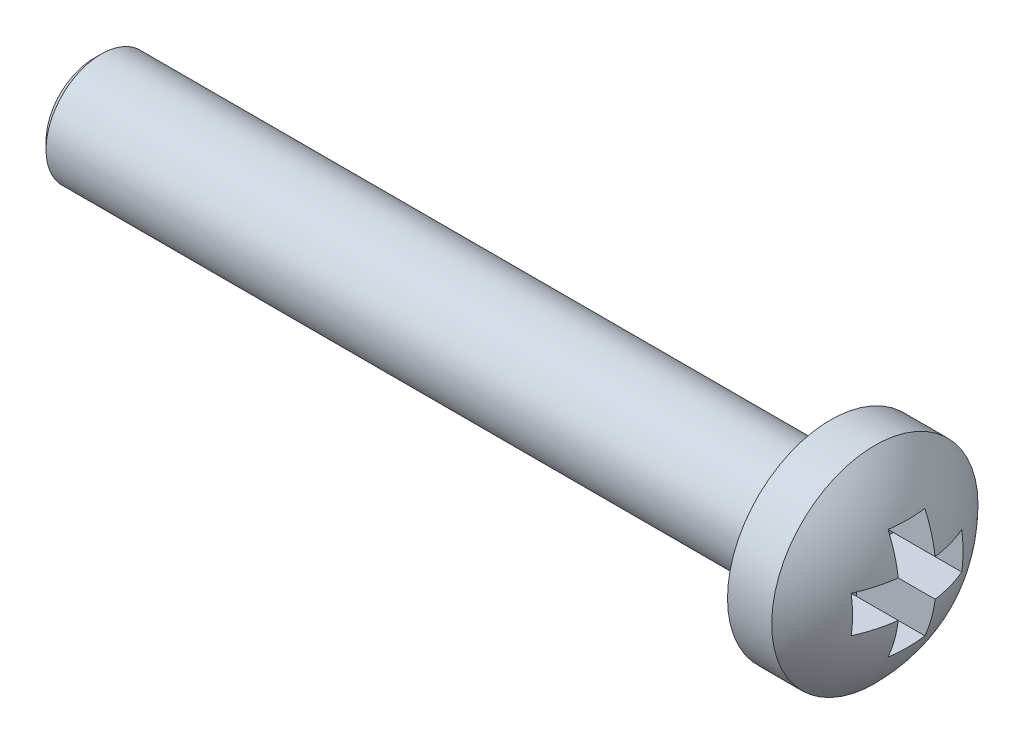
ISO-10303-21;
HEADER;
FILE_DESCRIPTION(('STEP AP214'),'2;1');
FILE_NAME('part.step','',(''),(''),'','','');
FILE_SCHEMA(('AUTOMOTIVE_DESIGN { 1 0 10303 214 1 1 1 1 }'));
ENDSEC;
DATA;
#1=APPLICATION_CONTEXT('core data for automotive mechanical design processes');
#2=APPLICATION_PROTOCOL_DEFINITION('international standard','automotive_design',2000,#1);
#3=PRODUCT_CONTEXT('',#1,'mechanical');
#4=PRODUCT('Part','Part','',(#3));
#5=PRODUCT_RELATED_PRODUCT_CATEGORY('part','',(#4));
#6=PRODUCT_DEFINITION_FORMATION('','',#4);
#7=PRODUCT_DEFINITION_CONTEXT('part definition',#1,'design');
#8=PRODUCT_DEFINITION('design','',#6,#7);
#9=PRODUCT_DEFINITION_SHAPE('','',#8);
#10=(LENGTH_UNIT() NAMED_UNIT(*) SI_UNIT(.MILLI.,.METRE.));
#11=(NAMED_UNIT(*) PLANE_ANGLE_UNIT() SI_UNIT($,.RADIAN.));
#12=(NAMED_UNIT(*) SI_UNIT($,.STERADIAN.) SOLID_ANGLE_UNIT());
#13=UNCERTAINTY_MEASURE_WITH_UNIT(LENGTH_MEASURE(1.E-05),#10,'distance_accuracy_value','');
#14=(GEOMETRIC_REPRESENTATION_CONTEXT(3) GLOBAL_UNCERTAINTY_ASSIGNED_CONTEXT((#13)) GLOBAL_UNIT_ASSIGNED_CONTEXT((#10,
#11,#12)) REPRESENTATION_CONTEXT('',''));
#15=CARTESIAN_POINT('',(0.,0.,0.));
#16=DIRECTION('',(0.,0.,1.));
#17=DIRECTION('',(1.,0.,0.));
#18=AXIS2_PLACEMENT_3D('',#15,#16,#17);
#19=CARTESIAN_POINT('',(2.4,0.,0.));
#20=CARTESIAN_POINT('',(2.4,-1.57169168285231,0.));
#21=CARTESIAN_POINT('',(1.2,-2.8,0.));
#22=B_SPLINE_CURVE_WITH_KNOTS('',2,(#19,#20,#21),.UNSPECIFIED.,.F.,.F.,(3,3),(0.,1.),.UNSPECIFIED.);
#23=CARTESIAN_POINT('',(11.0618266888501,0.,0.));
#24=DIRECTION('',(1.,0.,0.));
#25=AXIS1_PLACEMENT('',#23,#24);
#26=SURFACE_OF_REVOLUTION('',#22,#25);
#27=CARTESIAN_POINT('',(1.2,0.,0.));
#28=DIRECTION('',(1.,0.,0.));
#29=DIRECTION('',(0.,0.,-1.));
#30=AXIS2_PLACEMENT_3D('',#27,#28,#29);
#31=CIRCLE('',#30,2.8);
#32=CARTESIAN_POINT('',(1.2,0.,-2.8));
#33=VERTEX_POINT('',#32);
#34=EDGE_CURVE('E265',#33,#33,#31,.T.);
#35=ORIENTED_EDGE('',*,*,#34,.T.);
#36=EDGE_LOOP('',(#35));
#37=FACE_BOUND('',#36,.T.);
#38=CARTESIAN_POINT('',(2.05758661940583,0.500000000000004,1.49999999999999));
#39=CARTESIAN_POINT('',(2.08308448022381,0.500000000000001,1.44179657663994));
#40=CARTESIAN_POINT('',(2.10709470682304,0.5,1.38295700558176));
#41=CARTESIAN_POINT('',(2.1520554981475,0.5,1.26410705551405));
#42=CARTESIAN_POINT('',(2.17300544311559,0.5,1.204096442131));
#43=CARTESIAN_POINT('',(2.23082558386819,0.5,1.02342732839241));
#44=CARTESIAN_POINT('',(2.2630608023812,0.499999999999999,0.901232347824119));
#45=CARTESIAN_POINT('',(2.29852160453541,0.499999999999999,0.731861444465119));
#46=CARTESIAN_POINT('',(2.30725171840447,0.5,0.685768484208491));
#47=CARTESIAN_POINT('',(2.3229806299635,0.5,0.593159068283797));
#48=CARTESIAN_POINT('',(2.32997465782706,0.5,0.546641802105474));
#49=CARTESIAN_POINT('',(2.33609517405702,0.5,0.500000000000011));
#50=B_SPLINE_CURVE_WITH_KNOTS('',3,(#38,#39,#40,#41,#42,#43,#44,#45,#46,#47,#48,#49),
.UNSPECIFIED.,.F.,.F.,(4,2,2,2,2,4),(0.,0.190580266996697,0.381199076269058,0.759504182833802,
0.900218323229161,1.04131489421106),.UNSPECIFIED.);
#51=CARTESIAN_POINT('',(2.05758661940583,0.5,1.5));
#52=VERTEX_POINT('',#51);
#53=CARTESIAN_POINT('',(2.33609517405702,0.5,0.500000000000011));
#54=VERTEX_POINT('',#53);
#55=EDGE_CURVE('E167',#52,#54,#50,.T.);
#56=ORIENTED_EDGE('',*,*,#55,.T.);
#57=CARTESIAN_POINT('',(2.33609517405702,0.5,0.500000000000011));
#58=CARTESIAN_POINT('',(2.32797490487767,0.561927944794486,0.500000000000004));
#59=CARTESIAN_POINT('',(2.31830112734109,0.623654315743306,0.500000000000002));
#60=CARTESIAN_POINT('',(2.29584316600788,0.746540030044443,0.499999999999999));
#61=CARTESIAN_POINT('',(2.28305889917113,0.807699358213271,0.5));
#62=CARTESIAN_POINT('',(2.25447928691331,0.928850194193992,0.500000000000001));
#63=CARTESIAN_POINT('',(2.23870606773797,0.988846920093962,0.500000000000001));
#64=CARTESIAN_POINT('',(2.20412521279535,1.10795747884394,0.5));
#65=CARTESIAN_POINT('',(2.1853177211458,1.16707135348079,0.5));
#66=CARTESIAN_POINT('',(2.14895095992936,1.27208335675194,0.5));
#67=CARTESIAN_POINT('',(2.13194503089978,1.3181740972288,0.5));
#68=CARTESIAN_POINT('',(2.09611683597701,1.40963903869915,0.500000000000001));
#69=CARTESIAN_POINT('',(2.07729474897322,1.45501330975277,0.500000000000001));
#70=CARTESIAN_POINT('',(2.05758661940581,1.5,0.5));
#71=B_SPLINE_CURVE_WITH_KNOTS('',3,(#57,#58,#59,#60,#61,#62,#63,#64,#65,#66,#67,#68,#69,#70),
.UNSPECIFIED.,.F.,.F.,(4,2,2,2,2,2,4),(0.,0.187357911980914,0.374720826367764,0.560747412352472,
0.746765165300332,0.894111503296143,1.0414433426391),.UNSPECIFIED.);
#72=CARTESIAN_POINT('',(2.05758661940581,1.5,0.5));
#73=VERTEX_POINT('',#72);
#74=EDGE_CURVE('E11',#54,#73,#71,.T.);
#75=ORIENTED_EDGE('',*,*,#74,.T.);
#76=CARTESIAN_POINT('',(2.05758661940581,1.5,0.500000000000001));
#77=CARTESIAN_POINT('',(2.07601190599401,1.5,0.374107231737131));
#78=CARTESIAN_POINT('',(2.08741865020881,1.5,0.247173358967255));
#79=CARTESIAN_POINT('',(2.09618340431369,1.5,-0.00617564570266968));
#80=CARTESIAN_POINT('',(2.09365159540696,1.5,-0.132586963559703));
#81=CARTESIAN_POINT('',(2.07818848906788,1.5,-0.339263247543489));
#82=CARTESIAN_POINT('',(2.0693049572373,1.5,-0.419846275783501));
#83=CARTESIAN_POINT('',(2.05758661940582,1.5,-0.499999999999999));
#84=B_SPLINE_CURVE_WITH_KNOTS('',3,(#76,#77,#78,#79,#80,#81,#82,#83),.UNSPECIFIED.,.F.,.F.,(4,2,
2,4),(0.,0.381541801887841,0.760071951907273,1.00308018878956),.UNSPECIFIED.);
#85=CARTESIAN_POINT('',(2.05758661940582,1.5,-0.5));
#86=VERTEX_POINT('',#85);
#87=EDGE_CURVE('E45',#73,#86,#84,.T.);
#88=ORIENTED_EDGE('',*,*,#87,.T.);
#89=CARTESIAN_POINT('',(2.05758661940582,1.5,-0.499999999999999));
#90=CARTESIAN_POINT('',(2.08308448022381,1.44179657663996,-0.499999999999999));
#91=CARTESIAN_POINT('',(2.10709470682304,1.38295700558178,-0.5));
#92=CARTESIAN_POINT('',(2.1520554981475,1.26410705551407,-0.5));
#93=CARTESIAN_POINT('',(2.17300544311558,1.20409644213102,-0.5));
#94=CARTESIAN_POINT('',(2.23082558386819,1.02342732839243,-0.499999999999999));
#95=CARTESIAN_POINT('',(2.2630608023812,0.901232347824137,-0.499999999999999));
#96=CARTESIAN_POINT('',(2.29852160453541,0.731861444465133,-0.499999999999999));
#97=CARTESIAN_POINT('',(2.30725171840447,0.685768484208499,-0.499999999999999));
#98=CARTESIAN_POINT('',(2.3229806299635,0.593159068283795,-0.5));
#99=CARTESIAN_POINT('',(2.32997465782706,0.546641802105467,-0.5));
#100=CARTESIAN_POINT('',(2.33609517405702,0.5,-0.5));
#101=B_SPLINE_CURVE_WITH_KNOTS('',3,(#89,#90,#91,#92,#93,#94,#95,#96,#97,#98,#99,#100),
.UNSPECIFIED.,.F.,.F.,(4,2,2,2,2,4),(0.,0.190580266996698,0.381199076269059,0.759504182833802,
0.900218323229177,1.04131489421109),.UNSPECIFIED.);
#102=CARTESIAN_POINT('',(2.33609517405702,0.5,-0.5));
#103=VERTEX_POINT('',#102);
#104=EDGE_CURVE('E231',#86,#103,#101,.T.);
#105=ORIENTED_EDGE('',*,*,#104,.T.);
#106=CARTESIAN_POINT('',(2.33609517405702,0.5,-0.5));
#107=CARTESIAN_POINT('',(2.32797490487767,0.5,-0.561927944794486));
#108=CARTESIAN_POINT('',(2.31830112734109,0.5,-0.623654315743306));
#109=CARTESIAN_POINT('',(2.29584316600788,0.5,-0.746540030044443));
#110=CARTESIAN_POINT('',(2.28305889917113,0.5,-0.807699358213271));
#111=CARTESIAN_POINT('',(2.25447928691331,0.5,-0.928850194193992));
#112=CARTESIAN_POINT('',(2.23870606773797,0.5,-0.988846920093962));
#113=CARTESIAN_POINT('',(2.20412521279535,0.5,-1.10795747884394));
#114=CARTESIAN_POINT('',(2.1853177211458,0.5,-1.16707135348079));
#115=CARTESIAN_POINT('',(2.14895095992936,0.5,-1.27208335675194));
#116=CARTESIAN_POINT('',(2.13194503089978,0.5,-1.31817409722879));
#117=CARTESIAN_POINT('',(2.09611683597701,0.5,-1.40963903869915));
#118=CARTESIAN_POINT('',(2.07729474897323,0.5,-1.45501330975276));
#119=CARTESIAN_POINT('',(2.05758661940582,0.5,-1.49999999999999));
#120=B_SPLINE_CURVE_WITH_KNOTS('',3,(#106,#107,#108,#109,#110,#111,#112,#113,#114,#115,#116,
#117,#118,#119),.UNSPECIFIED.,.F.,.F.,(4,2,2,2,2,2,4),(0.,0.187357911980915,0.374720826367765,
0.560747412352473,0.746765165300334,0.894111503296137,1.04144334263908),.UNSPECIFIED.);
#121=CARTESIAN_POINT('',(2.05758661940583,0.5,-1.5));
#122=VERTEX_POINT('',#121);
#123=EDGE_CURVE('E225',#103,#122,#120,.T.);
#124=ORIENTED_EDGE('',*,*,#123,.T.);
#125=CARTESIAN_POINT('',(2.05758661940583,0.500000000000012,-1.49999999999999));
#126=CARTESIAN_POINT('',(2.07601190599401,0.374107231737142,-1.5));
#127=CARTESIAN_POINT('',(2.0874186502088,0.247173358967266,-1.5));
#128=CARTESIAN_POINT('',(2.09618340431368,-0.00617564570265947,-1.5));
#129=CARTESIAN_POINT('',(2.09365159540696,-0.132586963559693,-1.5));
#130=CARTESIAN_POINT('',(2.07818848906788,-0.339263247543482,-1.5));
#131=CARTESIAN_POINT('',(2.0693049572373,-0.419846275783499,-1.5));
#132=CARTESIAN_POINT('',(2.05758661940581,-0.500000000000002,-1.5));
#133=B_SPLINE_CURVE_WITH_KNOTS('',3,(#125,#126,#127,#128,#129,#130,#131,#132),.UNSPECIFIED.,.F.,
.F.,(4,2,2,4),(0.,0.38154180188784,0.760071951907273,1.00308018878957),.UNSPECIFIED.);
#134=CARTESIAN_POINT('',(2.05758661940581,-0.5,-1.5));
#135=VERTEX_POINT('',#134);
#136=EDGE_CURVE('E218',#122,#135,#133,.T.);
#137=ORIENTED_EDGE('',*,*,#136,.T.);
#138=CARTESIAN_POINT('',(2.05758661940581,-0.500000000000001,-1.5));
#139=CARTESIAN_POINT('',(2.0830844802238,-0.5,-1.44179657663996));
#140=CARTESIAN_POINT('',(2.10709470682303,-0.5,-1.38295700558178));
#141=CARTESIAN_POINT('',(2.1520554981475,-0.5,-1.26410705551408));
#142=CARTESIAN_POINT('',(2.17300544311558,-0.5,-1.20409644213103));
#143=CARTESIAN_POINT('',(2.23082558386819,-0.5,-1.02342732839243));
#144=CARTESIAN_POINT('',(2.2630608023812,-0.499999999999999,-0.901232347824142));
#145=CARTESIAN_POINT('',(2.29852160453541,-0.5,-0.731861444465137));
#146=CARTESIAN_POINT('',(2.30725171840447,-0.5,-0.685768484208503));
#147=CARTESIAN_POINT('',(2.3229806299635,-0.5,-0.593159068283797));
#148=CARTESIAN_POINT('',(2.32997465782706,-0.5,-0.546641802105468));
#149=CARTESIAN_POINT('',(2.33609517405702,-0.5,-0.5));
#150=B_SPLINE_CURVE_WITH_KNOTS('',3,(#138,#139,#140,#141,#142,#143,#144,#145,#146,#147,#148,
#149),.UNSPECIFIED.,.F.,.F.,(4,2,2,2,2,4),(0.,0.190580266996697,0.381199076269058,
0.759504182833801,0.900218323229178,1.0413148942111),.UNSPECIFIED.);
#151=CARTESIAN_POINT('',(2.33609517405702,-0.5,-0.5));
#152=VERTEX_POINT('',#151);
#153=EDGE_CURVE('E211',#135,#152,#150,.T.);
#154=ORIENTED_EDGE('',*,*,#153,.T.);
#155=CARTESIAN_POINT('',(2.33609517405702,-0.5,-0.5));
#156=CARTESIAN_POINT('',(2.32797490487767,-0.561927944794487,-0.5));
#157=CARTESIAN_POINT('',(2.31830112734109,-0.623654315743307,-0.5));
#158=CARTESIAN_POINT('',(2.29584316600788,-0.746540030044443,-0.5));
#159=CARTESIAN_POINT('',(2.28305889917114,-0.807699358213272,-0.5));
#160=CARTESIAN_POINT('',(2.25447928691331,-0.928850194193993,-0.5));
#161=CARTESIAN_POINT('',(2.23870606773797,-0.988846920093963,-0.5));
#162=CARTESIAN_POINT('',(2.20412521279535,-1.10795747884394,-0.5));
#163=CARTESIAN_POINT('',(2.1853177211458,-1.16707135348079,-0.5));
#164=CARTESIAN_POINT('',(2.14895095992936,-1.27208335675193,-0.5));
#165=CARTESIAN_POINT('',(2.13194503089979,-1.31817409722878,-0.5));
#166=CARTESIAN_POINT('',(2.09611683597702,-1.40963903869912,-0.499999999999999));
#167=CARTESIAN_POINT('',(2.07729474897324,-1.45501330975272,-0.499999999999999));
#168=CARTESIAN_POINT('',(2.05758661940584,-1.49999999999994,-0.499999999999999));
#169=B_SPLINE_CURVE_WITH_KNOTS('',3,(#155,#156,#157,#158,#159,#160,#161,#162,#163,#164,#165,
#166,#167,#168),.UNSPECIFIED.,.F.,.F.,(4,2,2,2,2,2,4),(0.,0.187357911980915,0.374720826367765,
0.560747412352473,0.746765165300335,0.894111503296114,1.04144334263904),.UNSPECIFIED.);
#170=CARTESIAN_POINT('',(2.05758661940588,-1.5,-0.5));
#171=VERTEX_POINT('',#170);
#172=EDGE_CURVE('E204',#152,#171,#169,.T.);
#173=ORIENTED_EDGE('',*,*,#172,.T.);
#174=CARTESIAN_POINT('',(2.05758661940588,-1.49999999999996,-0.499999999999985));
#175=CARTESIAN_POINT('',(2.07601190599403,-1.49999999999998,-0.374107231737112));
#176=CARTESIAN_POINT('',(2.08741865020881,-1.5,-0.247173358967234));
#177=CARTESIAN_POINT('',(2.09618340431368,-1.5,0.00617564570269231));
#178=CARTESIAN_POINT('',(2.09365159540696,-1.5,0.132586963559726));
#179=CARTESIAN_POINT('',(2.07818848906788,-1.5,0.339263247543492));
#180=CARTESIAN_POINT('',(2.06930495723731,-1.5,0.419846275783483));
#181=CARTESIAN_POINT('',(2.05758661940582,-1.5,0.499999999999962));
#182=B_SPLINE_CURVE_WITH_KNOTS('',3,(#174,#175,#176,#177,#178,#179,#180,#181),.UNSPECIFIED.,.F.,
.F.,(4,2,2,4),(0.,0.38154180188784,0.760071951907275,1.0030801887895),.UNSPECIFIED.);
#183=CARTESIAN_POINT('',(2.05758661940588,-1.5,0.5));
#184=VERTEX_POINT('',#183);
#185=EDGE_CURVE('E197',#171,#184,#182,.T.);
#186=ORIENTED_EDGE('',*,*,#185,.T.);
#187=CARTESIAN_POINT('',(2.05758661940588,-1.49999999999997,0.499999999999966));
#188=CARTESIAN_POINT('',(2.08308448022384,-1.44179657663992,0.499999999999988));
#189=CARTESIAN_POINT('',(2.10709470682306,-1.38295700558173,0.499999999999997));
#190=CARTESIAN_POINT('',(2.15205549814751,-1.26410705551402,0.500000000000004));
#191=CARTESIAN_POINT('',(2.1730054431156,-1.20409644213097,0.500000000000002));
#192=CARTESIAN_POINT('',(2.2308255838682,-1.02342732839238,0.499999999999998));
#193=CARTESIAN_POINT('',(2.26306080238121,-0.901232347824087,0.499999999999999));
#194=CARTESIAN_POINT('',(2.29852160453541,-0.73186144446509,0.5));
#195=CARTESIAN_POINT('',(2.30725171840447,-0.685768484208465,0.5));
#196=CARTESIAN_POINT('',(2.3229806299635,-0.593159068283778,0.500000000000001));
#197=CARTESIAN_POINT('',(2.32997465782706,-0.546641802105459,0.500000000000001));
#198=CARTESIAN_POINT('',(2.33609517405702,-0.5,0.5));
#199=B_SPLINE_CURVE_WITH_KNOTS('',3,(#187,#188,#189,#190,#191,#192,#193,#194,#195,#196,#197,
#198),.UNSPECIFIED.,.F.,.F.,(4,2,2,2,2,4),(0.,0.190580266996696,0.381199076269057,
0.759504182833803,0.900218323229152,1.04131489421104),.UNSPECIFIED.);
#200=CARTESIAN_POINT('',(2.33609517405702,-0.5,0.5));
#201=VERTEX_POINT('',#200);
#202=EDGE_CURVE('E190',#184,#201,#199,.T.);
#203=ORIENTED_EDGE('',*,*,#202,.T.);
#204=CARTESIAN_POINT('',(2.33609517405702,-0.5,0.5));
#205=CARTESIAN_POINT('',(2.32797490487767,-0.5,0.561927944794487));
#206=CARTESIAN_POINT('',(2.31830112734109,-0.5,0.623654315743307));
#207=CARTESIAN_POINT('',(2.29584316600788,-0.5,0.746540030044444));
#208=CARTESIAN_POINT('',(2.28305889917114,-0.5,0.807699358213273));
#209=CARTESIAN_POINT('',(2.25447928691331,-0.5,0.928850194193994));
#210=CARTESIAN_POINT('',(2.23870606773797,-0.5,0.988846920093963));
#211=CARTESIAN_POINT('',(2.20412521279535,-0.5,1.10795747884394));
#212=CARTESIAN_POINT('',(2.1853177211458,-0.500000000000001,1.16707135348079));
#213=CARTESIAN_POINT('',(2.14895095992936,-0.500000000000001,1.27208335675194));
#214=CARTESIAN_POINT('',(2.13194503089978,-0.5,1.3181740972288));
#215=CARTESIAN_POINT('',(2.09611683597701,-0.5,1.40963903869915));
#216=CARTESIAN_POINT('',(2.07729474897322,-0.5,1.45501330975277));
#217=CARTESIAN_POINT('',(2.05758661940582,-0.500000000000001,1.5));
#218=B_SPLINE_CURVE_WITH_KNOTS('',3,(#204,#205,#206,#207,#208,#209,#210,#211,#212,#213,#214,
#215,#216,#217),.UNSPECIFIED.,.F.,.F.,(4,2,2,2,2,2,4),(0.,0.187357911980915,0.374720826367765,
0.560747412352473,0.746765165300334,0.894111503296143,1.0414433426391),.UNSPECIFIED.);
#219=CARTESIAN_POINT('',(2.05758661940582,-0.5,1.5));
#220=VERTEX_POINT('',#219);
#221=EDGE_CURVE('E183',#201,#220,#218,.T.);
#222=ORIENTED_EDGE('',*,*,#221,.T.);
#223=CARTESIAN_POINT('',(2.05758661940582,-0.499999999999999,1.5));
#224=CARTESIAN_POINT('',(2.07601190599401,-0.374107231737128,1.5));
#225=CARTESIAN_POINT('',(2.0874186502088,-0.247173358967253,1.5));
#226=CARTESIAN_POINT('',(2.09618340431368,0.00617564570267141,1.5));
#227=CARTESIAN_POINT('',(2.09365159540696,0.132586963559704,1.5));
#228=CARTESIAN_POINT('',(2.07818848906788,0.339263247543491,1.5));
#229=CARTESIAN_POINT('',(2.0693049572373,0.419846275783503,1.5));
#230=CARTESIAN_POINT('',(2.05758661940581,0.500000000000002,1.5));
#231=B_SPLINE_CURVE_WITH_KNOTS('',3,(#223,#224,#225,#226,#227,#228,#229,#230),.UNSPECIFIED.,.F.,
.F.,(4,2,2,4),(0.,0.38154180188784,0.760071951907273,1.00308018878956),.UNSPECIFIED.);
#232=EDGE_CURVE('E176',#220,#52,#231,.T.);
#233=ORIENTED_EDGE('',*,*,#232,.T.);
#234=EDGE_LOOP('',(#56,#75,#88,#105,#124,#137,#154,#173,#186,#203,#222,#233));
#235=FACE_BOUND('',#234,.T.);
#236=ADVANCED_FACE('F33',(#37,#235),#26,.F.);
#237=CARTESIAN_POINT('',(11.0618266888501,0.,0.));
#238=DIRECTION('',(1.,0.,0.));
#239=DIRECTION('',(0.,0.,-1.));
#240=AXIS2_PLACEMENT_3D('',#237,#238,#239);
#241=CYLINDRICAL_SURFACE('',#240,2.8);
#242=CARTESIAN_POINT('',(0.,0.,0.));
#243=DIRECTION('',(1.,0.,0.));
#244=DIRECTION('',(0.,0.,-1.));
#245=AXIS2_PLACEMENT_3D('',#242,#243,#244);
#246=CIRCLE('',#245,2.8);
#247=CARTESIAN_POINT('',(0.,0.,-2.8));
#248=VERTEX_POINT('',#247);
#249=EDGE_CURVE('E145',#248,#248,#246,.T.);
#250=ORIENTED_EDGE('',*,*,#249,.T.);
#251=EDGE_LOOP('',(#250));
#252=FACE_BOUND('',#251,.T.);
#253=ORIENTED_EDGE('',*,*,#34,.F.);
#254=EDGE_LOOP('',(#253));
#255=FACE_BOUND('',#254,.T.);
#256=ADVANCED_FACE('F161',(#252,#255),#241,.T.);
#257=CARTESIAN_POINT('',(0.,-1.5,0.));
#258=DIRECTION('',(-1.,0.,0.));
#259=DIRECTION('',(0.,0.,1.));
#260=AXIS2_PLACEMENT_3D('',#257,#258,#259);
#261=PLANE('',#260);
#262=CARTESIAN_POINT('',(0.,0.,0.));
#263=DIRECTION('',(1.,0.,0.));
#264=DIRECTION('',(0.,0.,-1.));
#265=AXIS2_PLACEMENT_3D('',#262,#263,#264);
#266=CIRCLE('',#265,1.5);
#267=CARTESIAN_POINT('',(0.,0.,-1.5));
#268=VERTEX_POINT('',#267);
#269=EDGE_CURVE('E141',#268,#268,#266,.T.);
#270=ORIENTED_EDGE('',*,*,#269,.T.);
#271=EDGE_LOOP('',(#270));
#272=FACE_BOUND('',#271,.T.);
#273=ORIENTED_EDGE('',*,*,#249,.F.);
#274=EDGE_LOOP('',(#273));
#275=FACE_BOUND('',#274,.T.);
#276=ADVANCED_FACE('F253',(#272,#275),#261,.T.);
#277=CARTESIAN_POINT('',(11.0618266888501,0.,0.));
#278=DIRECTION('',(1.,0.,0.));
#279=DIRECTION('',(0.,0.,-1.));
#280=AXIS2_PLACEMENT_3D('',#277,#278,#279);
#281=CYLINDRICAL_SURFACE('',#280,1.5);
#282=CARTESIAN_POINT('',(-19.8,0.,0.));
#283=DIRECTION('',(-1.,0.,0.));
#284=DIRECTION('',(0.,0.,1.));
#285=AXIS2_PLACEMENT_3D('',#282,#283,#284);
#286=CIRCLE('',#285,1.5);
#287=CARTESIAN_POINT('',(-19.8,0.,1.5));
#288=VERTEX_POINT('',#287);
#289=EDGE_CURVE('E267',#288,#288,#286,.F.);
#290=ORIENTED_EDGE('',*,*,#289,.T.);
#291=EDGE_LOOP('',(#290));
#292=FACE_BOUND('',#291,.T.);
#293=ORIENTED_EDGE('',*,*,#269,.F.);
#294=EDGE_LOOP('',(#293));
#295=FACE_BOUND('',#294,.T.);
#296=ADVANCED_FACE('F250',(#292,#295),#281,.T.);
#297=CARTESIAN_POINT('',(-20.,-1.5,0.));
#298=DIRECTION('',(-1.,0.,0.));
#299=DIRECTION('',(0.,0.,1.));
#300=AXIS2_PLACEMENT_3D('',#297,#298,#299);
#301=PLANE('',#300);
#302=CARTESIAN_POINT('',(-20.,0.,0.));
#303=DIRECTION('',(-1.,0.,0.));
#304=DIRECTION('',(0.,0.,1.));
#305=AXIS2_PLACEMENT_3D('',#302,#303,#304);
#306=CIRCLE('',#305,1.29999999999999);
#307=CARTESIAN_POINT('',(-20.,0.,1.29999999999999));
#308=VERTEX_POINT('',#307);
#309=EDGE_CURVE('E271',#308,#308,#306,.T.);
#310=ORIENTED_EDGE('',*,*,#309,.T.);
#311=EDGE_LOOP('',(#310));
#312=FACE_BOUND('',#311,.T.);
#313=ADVANCED_FACE('F247',(#312),#301,.T.);
#314=CARTESIAN_POINT('',(-19.8,0.,0.));
#315=DIRECTION('',(1.,0.,0.));
#316=DIRECTION('',(0.,0.,-1.));
#317=AXIS2_PLACEMENT_3D('',#314,#315,#316);
#318=CONICAL_SURFACE('',#317,1.5,0.785398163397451);
#319=ORIENTED_EDGE('',*,*,#309,.F.);
#320=EDGE_LOOP('',(#319));
#321=FACE_BOUND('',#320,.T.);
#322=ORIENTED_EDGE('',*,*,#289,.F.);
#323=EDGE_LOOP('',(#322));
#324=FACE_BOUND('',#323,.T.);
#325=ADVANCED_FACE('F35',(#321,#324),#318,.T.);
#326=CARTESIAN_POINT('',(0.2,1.5,0.5));
#327=DIRECTION('',(0.,0.,-1.));
#328=DIRECTION('',(-1.,0.,0.));
#329=AXIS2_PLACEMENT_3D('',#326,#327,#328);
#330=PLANE('',#329);
#331=DIRECTION('',(1.,0.,0.));
#332=VECTOR('',#331,1.);
#333=CARTESIAN_POINT('',(0.2,0.5,0.5));
#334=LINE('',#333,#332);
#335=CARTESIAN_POINT('',(0.2,0.5,0.5));
#336=VERTEX_POINT('',#335);
#337=EDGE_CURVE('E52',#336,#54,#334,.T.);
#338=ORIENTED_EDGE('',*,*,#337,.F.);
#339=DIRECTION('',(0.,1.,0.));
#340=VECTOR('',#339,1.);
#341=CARTESIAN_POINT('',(0.2,1.5,0.5));
#342=LINE('',#341,#340);
#343=CARTESIAN_POINT('',(0.2,1.5,0.5));
#344=VERTEX_POINT('',#343);
#345=EDGE_CURVE('E131',#336,#344,#342,.T.);
#346=ORIENTED_EDGE('',*,*,#345,.T.);
#347=DIRECTION('',(1.,0.,0.));
#348=VECTOR('',#347,1.);
#349=CARTESIAN_POINT('',(0.2,1.5,0.5));
#350=LINE('',#349,#348);
#351=EDGE_CURVE('E138',#344,#73,#350,.T.);
#352=ORIENTED_EDGE('',*,*,#351,.T.);
#353=ORIENTED_EDGE('',*,*,#74,.F.);
#354=EDGE_LOOP('',(#338,#346,#352,#353));
#355=FACE_BOUND('',#354,.T.);
#356=ADVANCED_FACE('F137',(#355),#330,.T.);
#357=CARTESIAN_POINT('',(0.2,1.5,0.5));
#358=DIRECTION('',(0.,-1.,0.));
#359=DIRECTION('',(0.,0.,-1.));
#360=AXIS2_PLACEMENT_3D('',#357,#358,#359);
#361=PLANE('',#360);
#362=ORIENTED_EDGE('',*,*,#351,.F.);
#363=DIRECTION('',(0.,0.,-1.));
#364=VECTOR('',#363,1.);
#365=CARTESIAN_POINT('',(0.2,1.5,0.5));
#366=LINE('',#365,#364);
#367=CARTESIAN_POINT('',(0.2,1.5,-0.5));
#368=VERTEX_POINT('',#367);
#369=EDGE_CURVE('E127',#344,#368,#366,.T.);
#370=ORIENTED_EDGE('',*,*,#369,.T.);
#371=DIRECTION('',(1.,0.,0.));
#372=VECTOR('',#371,1.);
#373=CARTESIAN_POINT('',(0.2,1.5,-0.5));
#374=LINE('',#373,#372);
#375=EDGE_CURVE('E142',#368,#86,#374,.T.);
#376=ORIENTED_EDGE('',*,*,#375,.T.);
#377=ORIENTED_EDGE('',*,*,#87,.F.);
#378=EDGE_LOOP('',(#362,#370,#376,#377));
#379=FACE_BOUND('',#378,.T.);
#380=ADVANCED_FACE('F140',(#379),#361,.T.);
#381=CARTESIAN_POINT('',(0.2,1.5,-0.5));
#382=DIRECTION('',(0.,0.,1.));
#383=DIRECTION('',(1.,0.,0.));
#384=AXIS2_PLACEMENT_3D('',#381,#382,#383);
#385=PLANE('',#384);
#386=ORIENTED_EDGE('',*,*,#375,.F.);
#387=DIRECTION('',(0.,-1.,0.));
#388=VECTOR('',#387,1.);
#389=CARTESIAN_POINT('',(0.2,1.5,-0.5));
#390=LINE('',#389,#388);
#391=CARTESIAN_POINT('',(0.2,0.5,-0.5));
#392=VERTEX_POINT('',#391);
#393=EDGE_CURVE('E133',#368,#392,#390,.T.);
#394=ORIENTED_EDGE('',*,*,#393,.T.);
#395=DIRECTION('',(1.,0.,0.));
#396=VECTOR('',#395,1.);
#397=CARTESIAN_POINT('',(0.2,0.5,-0.5));
#398=LINE('',#397,#396);
#399=EDGE_CURVE('E147',#392,#103,#398,.T.);
#400=ORIENTED_EDGE('',*,*,#399,.T.);
#401=ORIENTED_EDGE('',*,*,#104,.F.);
#402=EDGE_LOOP('',(#386,#394,#400,#401));
#403=FACE_BOUND('',#402,.T.);
#404=ADVANCED_FACE('F242',(#403),#385,.T.);
#405=CARTESIAN_POINT('',(0.2,0.5,-0.5));
#406=DIRECTION('',(0.,-1.,0.));
#407=DIRECTION('',(0.,0.,-1.));
#408=AXIS2_PLACEMENT_3D('',#405,#406,#407);
#409=PLANE('',#408);
#410=ORIENTED_EDGE('',*,*,#399,.F.);
#411=DIRECTION('',(0.,0.,-1.));
#412=VECTOR('',#411,1.);
#413=CARTESIAN_POINT('',(0.2,0.5,-0.5));
#414=LINE('',#413,#412);
#415=CARTESIAN_POINT('',(0.2,0.5,-1.5));
#416=VERTEX_POINT('',#415);
#417=EDGE_CURVE('E331',#392,#416,#414,.T.);
#418=ORIENTED_EDGE('',*,*,#417,.T.);
#419=DIRECTION('',(1.,0.,0.));
#420=VECTOR('',#419,1.);
#421=CARTESIAN_POINT('',(0.2,0.5,-1.5));
#422=LINE('',#421,#420);
#423=EDGE_CURVE('E289',#416,#122,#422,.T.);
#424=ORIENTED_EDGE('',*,*,#423,.T.);
#425=ORIENTED_EDGE('',*,*,#123,.F.);
#426=EDGE_LOOP('',(#410,#418,#424,#425));
#427=FACE_BOUND('',#426,.T.);
#428=ADVANCED_FACE('F334',(#427),#409,.T.);
#429=CARTESIAN_POINT('',(0.2,0.5,-1.5));
#430=DIRECTION('',(0.,0.,1.));
#431=DIRECTION('',(1.,0.,0.));
#432=AXIS2_PLACEMENT_3D('',#429,#430,#431);
#433=PLANE('',#432);
#434=ORIENTED_EDGE('',*,*,#423,.F.);
#435=DIRECTION('',(0.,-1.,0.));
#436=VECTOR('',#435,1.);
#437=CARTESIAN_POINT('',(0.2,0.5,-1.5));
#438=LINE('',#437,#436);
#439=CARTESIAN_POINT('',(0.2,-0.5,-1.5));
#440=VERTEX_POINT('',#439);
#441=EDGE_CURVE('E329',#416,#440,#438,.T.);
#442=ORIENTED_EDGE('',*,*,#441,.T.);
#443=DIRECTION('',(1.,0.,0.));
#444=VECTOR('',#443,1.);
#445=CARTESIAN_POINT('',(0.2,-0.5,-1.5));
#446=LINE('',#445,#444);
#447=EDGE_CURVE('E291',#440,#135,#446,.T.);
#448=ORIENTED_EDGE('',*,*,#447,.T.);
#449=ORIENTED_EDGE('',*,*,#136,.F.);
#450=EDGE_LOOP('',(#434,#442,#448,#449));
#451=FACE_BOUND('',#450,.T.);
#452=ADVANCED_FACE('F337',(#451),#433,.T.);
#453=CARTESIAN_POINT('',(0.2,-0.5,-0.5));
#454=DIRECTION('',(0.,1.,0.));
#455=DIRECTION('',(0.,0.,1.));
#456=AXIS2_PLACEMENT_3D('',#453,#454,#455);
#457=PLANE('',#456);
#458=ORIENTED_EDGE('',*,*,#447,.F.);
#459=DIRECTION('',(0.,0.,1.));
#460=VECTOR('',#459,1.);
#461=CARTESIAN_POINT('',(0.2,-0.5,-0.5));
#462=LINE('',#461,#460);
#463=CARTESIAN_POINT('',(0.2,-0.5,-0.5));
#464=VERTEX_POINT('',#463);
#465=EDGE_CURVE('E327',#440,#464,#462,.T.);
#466=ORIENTED_EDGE('',*,*,#465,.T.);
#467=DIRECTION('',(1.,0.,0.));
#468=VECTOR('',#467,1.);
#469=CARTESIAN_POINT('',(0.2,-0.5,-0.5));
#470=LINE('',#469,#468);
#471=EDGE_CURVE('E296',#464,#152,#470,.T.);
#472=ORIENTED_EDGE('',*,*,#471,.T.);
#473=ORIENTED_EDGE('',*,*,#153,.F.);
#474=EDGE_LOOP('',(#458,#466,#472,#473));
#475=FACE_BOUND('',#474,.T.);
#476=ADVANCED_FACE('F344',(#475),#457,.T.);
#477=CARTESIAN_POINT('',(0.2,-0.5,-0.5));
#478=DIRECTION('',(0.,0.,1.));
#479=DIRECTION('',(0.,-1.,0.));
#480=AXIS2_PLACEMENT_3D('',#477,#478,#479);
#481=PLANE('',#480);
#482=ORIENTED_EDGE('',*,*,#471,.F.);
#483=DIRECTION('',(0.,-1.,0.));
#484=VECTOR('',#483,1.);
#485=CARTESIAN_POINT('',(0.2,-0.5,-0.5));
#486=LINE('',#485,#484);
#487=CARTESIAN_POINT('',(0.2,-1.5,-0.5));
#488=VERTEX_POINT('',#487);
#489=EDGE_CURVE('E325',#464,#488,#486,.T.);
#490=ORIENTED_EDGE('',*,*,#489,.T.);
#491=DIRECTION('',(1.,0.,0.));
#492=VECTOR('',#491,1.);
#493=CARTESIAN_POINT('',(0.2,-1.5,-0.5));
#494=LINE('',#493,#492);
#495=EDGE_CURVE('E299',#488,#171,#494,.T.);
#496=ORIENTED_EDGE('',*,*,#495,.T.);
#497=ORIENTED_EDGE('',*,*,#172,.F.);
#498=EDGE_LOOP('',(#482,#490,#496,#497));
#499=FACE_BOUND('',#498,.T.);
#500=ADVANCED_FACE('F346',(#499),#481,.T.);
#501=CARTESIAN_POINT('',(0.2,-1.5,0.5));
#502=DIRECTION('',(0.,1.,0.));
#503=DIRECTION('',(0.,0.,1.));
#504=AXIS2_PLACEMENT_3D('',#501,#502,#503);
#505=PLANE('',#504);
#506=ORIENTED_EDGE('',*,*,#495,.F.);
#507=DIRECTION('',(0.,0.,1.));
#508=VECTOR('',#507,1.);
#509=CARTESIAN_POINT('',(0.2,-1.5,0.5));
#510=LINE('',#509,#508);
#511=CARTESIAN_POINT('',(0.2,-1.5,0.5));
#512=VERTEX_POINT('',#511);
#513=EDGE_CURVE('E323',#488,#512,#510,.T.);
#514=ORIENTED_EDGE('',*,*,#513,.T.);
#515=DIRECTION('',(1.,0.,0.));
#516=VECTOR('',#515,1.);
#517=CARTESIAN_POINT('',(0.2,-1.5,0.5));
#518=LINE('',#517,#516);
#519=EDGE_CURVE('E302',#512,#184,#518,.T.);
#520=ORIENTED_EDGE('',*,*,#519,.T.);
#521=ORIENTED_EDGE('',*,*,#185,.F.);
#522=EDGE_LOOP('',(#506,#514,#520,#521));
#523=FACE_BOUND('',#522,.T.);
#524=ADVANCED_FACE('F349',(#523),#505,.T.);
#525=CARTESIAN_POINT('',(0.2,-0.5,0.5));
#526=DIRECTION('',(0.,0.,-1.));
#527=DIRECTION('',(-1.,0.,0.));
#528=AXIS2_PLACEMENT_3D('',#525,#526,#527);
#529=PLANE('',#528);
#530=ORIENTED_EDGE('',*,*,#519,.F.);
#531=DIRECTION('',(0.,1.,0.));
#532=VECTOR('',#531,1.);
#533=CARTESIAN_POINT('',(0.2,-0.5,0.5));
#534=LINE('',#533,#532);
#535=CARTESIAN_POINT('',(0.2,-0.5,0.5));
#536=VERTEX_POINT('',#535);
#537=EDGE_CURVE('E321',#512,#536,#534,.T.);
#538=ORIENTED_EDGE('',*,*,#537,.T.);
#539=DIRECTION('',(1.,0.,0.));
#540=VECTOR('',#539,1.);
#541=CARTESIAN_POINT('',(0.2,-0.5,0.5));
#542=LINE('',#541,#540);
#543=EDGE_CURVE('E305',#536,#201,#542,.T.);
#544=ORIENTED_EDGE('',*,*,#543,.T.);
#545=ORIENTED_EDGE('',*,*,#202,.F.);
#546=EDGE_LOOP('',(#530,#538,#544,#545));
#547=FACE_BOUND('',#546,.T.);
#548=ADVANCED_FACE('F356',(#547),#529,.T.);
#549=CARTESIAN_POINT('',(0.2,-0.5,1.5));
#550=DIRECTION('',(0.,1.,0.));
#551=DIRECTION('',(0.,0.,1.));
#552=AXIS2_PLACEMENT_3D('',#549,#550,#551);
#553=PLANE('',#552);
#554=ORIENTED_EDGE('',*,*,#543,.F.);
#555=DIRECTION('',(0.,0.,1.));
#556=VECTOR('',#555,1.);
#557=CARTESIAN_POINT('',(0.2,-0.5,1.5));
#558=LINE('',#557,#556);
#559=CARTESIAN_POINT('',(0.2,-0.5,1.5));
#560=VERTEX_POINT('',#559);
#561=EDGE_CURVE('E319',#536,#560,#558,.T.);
#562=ORIENTED_EDGE('',*,*,#561,.T.);
#563=DIRECTION('',(1.,0.,0.));
#564=VECTOR('',#563,1.);
#565=CARTESIAN_POINT('',(0.2,-0.5,1.5));
#566=LINE('',#565,#564);
#567=EDGE_CURVE('E308',#560,#220,#566,.T.);
#568=ORIENTED_EDGE('',*,*,#567,.T.);
#569=ORIENTED_EDGE('',*,*,#221,.F.);
#570=EDGE_LOOP('',(#554,#562,#568,#569));
#571=FACE_BOUND('',#570,.T.);
#572=ADVANCED_FACE('F358',(#571),#553,.T.);
#573=CARTESIAN_POINT('',(0.2,0.5,1.5));
#574=DIRECTION('',(0.,0.,-1.));
#575=DIRECTION('',(0.,1.,0.));
#576=AXIS2_PLACEMENT_3D('',#573,#574,#575);
#577=PLANE('',#576);
#578=ORIENTED_EDGE('',*,*,#567,.F.);
#579=DIRECTION('',(0.,1.,0.));
#580=VECTOR('',#579,1.);
#581=CARTESIAN_POINT('',(0.2,0.5,1.5));
#582=LINE('',#581,#580);
#583=CARTESIAN_POINT('',(0.2,0.5,1.5));
#584=VERTEX_POINT('',#583);
#585=EDGE_CURVE('E317',#560,#584,#582,.T.);
#586=ORIENTED_EDGE('',*,*,#585,.T.);
#587=DIRECTION('',(1.,0.,0.));
#588=VECTOR('',#587,1.);
#589=CARTESIAN_POINT('',(0.2,0.5,1.5));
#590=LINE('',#589,#588);
#591=EDGE_CURVE('E311',#584,#52,#590,.T.);
#592=ORIENTED_EDGE('',*,*,#591,.T.);
#593=ORIENTED_EDGE('',*,*,#232,.F.);
#594=EDGE_LOOP('',(#578,#586,#592,#593));
#595=FACE_BOUND('',#594,.T.);
#596=ADVANCED_FACE('F361',(#595),#577,.T.);
#597=CARTESIAN_POINT('',(0.2,0.5,1.5));
#598=DIRECTION('',(0.,-1.,0.));
#599=DIRECTION('',(0.,0.,-1.));
#600=AXIS2_PLACEMENT_3D('',#597,#598,#599);
#601=PLANE('',#600);
#602=ORIENTED_EDGE('',*,*,#591,.F.);
#603=DIRECTION('',(0.,0.,-1.));
#604=VECTOR('',#603,1.);
#605=CARTESIAN_POINT('',(0.2,0.5,1.5));
#606=LINE('',#605,#604);
#607=EDGE_CURVE('E315',#584,#336,#606,.T.);
#608=ORIENTED_EDGE('',*,*,#607,.T.);
#609=ORIENTED_EDGE('',*,*,#337,.T.);
#610=ORIENTED_EDGE('',*,*,#55,.F.);
#611=EDGE_LOOP('',(#602,#608,#609,#610));
#612=FACE_BOUND('',#611,.T.);
#613=ADVANCED_FACE('F363',(#612),#601,.T.);
#614=CARTESIAN_POINT('',(0.2,0.5,0.5));
#615=DIRECTION('',(1.,0.,0.));
#616=DIRECTION('',(0.,0.,-1.));
#617=AXIS2_PLACEMENT_3D('',#614,#615,#616);
#618=PLANE('',#617);
#619=ORIENTED_EDGE('',*,*,#345,.F.);
#620=ORIENTED_EDGE('',*,*,#607,.F.);
#621=ORIENTED_EDGE('',*,*,#585,.F.);
#622=ORIENTED_EDGE('',*,*,#561,.F.);
#623=ORIENTED_EDGE('',*,*,#537,.F.);
#624=ORIENTED_EDGE('',*,*,#513,.F.);
#625=ORIENTED_EDGE('',*,*,#489,.F.);
#626=ORIENTED_EDGE('',*,*,#465,.F.);
#627=ORIENTED_EDGE('',*,*,#441,.F.);
#628=ORIENTED_EDGE('',*,*,#417,.F.);
#629=ORIENTED_EDGE('',*,*,#393,.F.);
#630=ORIENTED_EDGE('',*,*,#369,.F.);
#631=EDGE_LOOP('',(#619,#620,#621,#622,#623,#624,#625,#626,#627,#628,#629,#630));
#632=FACE_BOUND('',#631,.T.);
#633=ADVANCED_FACE('F129',(#632),#618,.T.);
#634=CLOSED_SHELL('',(#236,#256,#276,#296,#313,#325,#356,#380,#404,#428,#452,#476,#500,#524,
#548,#572,#596,#613,#633));
#635=MANIFOLD_SOLID_BREP('B2',#634);
#636=ADVANCED_BREP_SHAPE_REPRESENTATION('',(#18,#635),#14);
#637=SHAPE_DEFINITION_REPRESENTATION(#9,#636);
ENDSEC;
END-ISO-10303-21;
